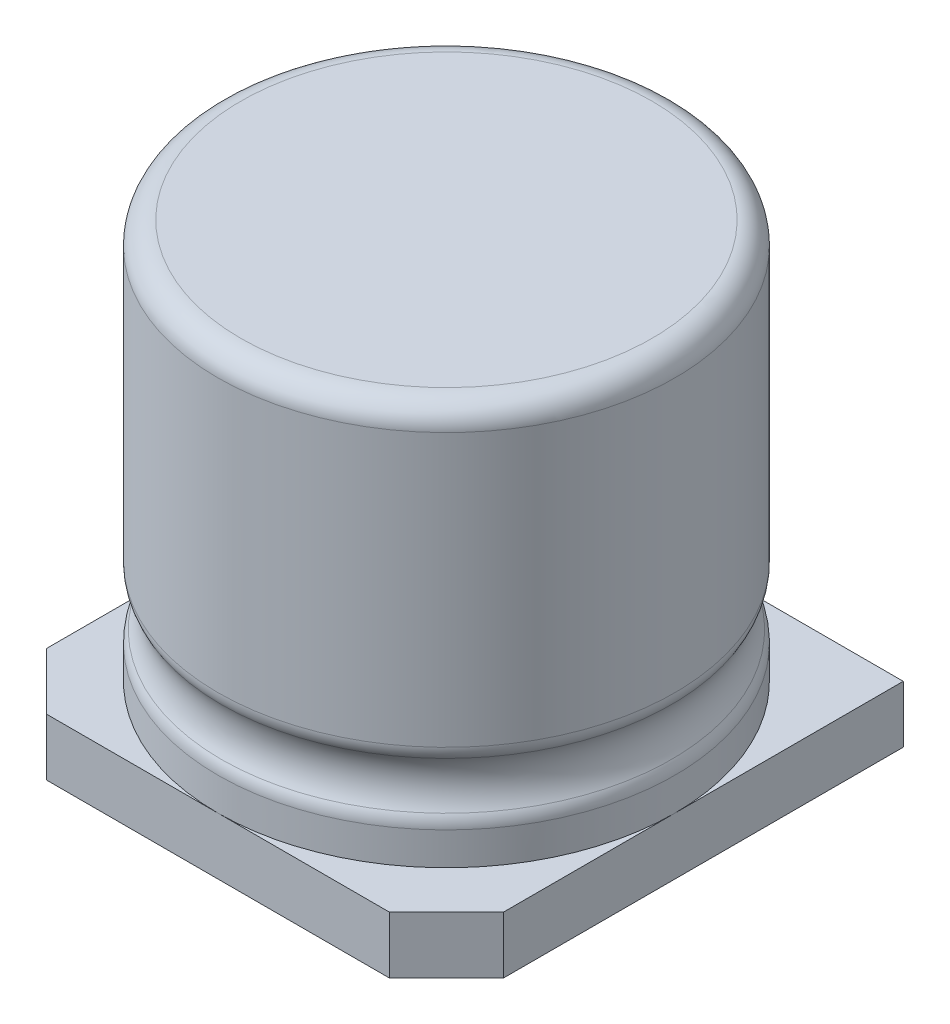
ISO-10303-21;
HEADER;
FILE_DESCRIPTION(('STEP AP214'),'2;1');
FILE_NAME('part.step','',(''),(''),'','','');
FILE_SCHEMA(('AUTOMOTIVE_DESIGN { 1 0 10303 214 1 1 1 1 }'));
ENDSEC;
DATA;
#1=APPLICATION_CONTEXT('core data for automotive mechanical design processes');
#2=APPLICATION_PROTOCOL_DEFINITION('international standard','automotive_design',2000,#1);
#3=PRODUCT_CONTEXT('',#1,'mechanical');
#4=PRODUCT('Part','Part','',(#3));
#5=PRODUCT_RELATED_PRODUCT_CATEGORY('part','',(#4));
#6=PRODUCT_DEFINITION_FORMATION('','',#4);
#7=PRODUCT_DEFINITION_CONTEXT('part definition',#1,'design');
#8=PRODUCT_DEFINITION('design','',#6,#7);
#9=PRODUCT_DEFINITION_SHAPE('','',#8);
#10=(LENGTH_UNIT() NAMED_UNIT(*) SI_UNIT(.MILLI.,.METRE.));
#11=(NAMED_UNIT(*) PLANE_ANGLE_UNIT() SI_UNIT($,.RADIAN.));
#12=(NAMED_UNIT(*) SI_UNIT($,.STERADIAN.) SOLID_ANGLE_UNIT());
#13=UNCERTAINTY_MEASURE_WITH_UNIT(LENGTH_MEASURE(1.E-05),#10,'distance_accuracy_value','');
#14=(GEOMETRIC_REPRESENTATION_CONTEXT(3) GLOBAL_UNCERTAINTY_ASSIGNED_CONTEXT((#13)) GLOBAL_UNIT_ASSIGNED_CONTEXT((#10,
#11,#12)) REPRESENTATION_CONTEXT('',''));
#15=CARTESIAN_POINT('',(0.,0.,0.));
#16=DIRECTION('',(0.,0.,1.));
#17=DIRECTION('',(1.,0.,0.));
#18=AXIS2_PLACEMENT_3D('',#15,#16,#17);
#19=CARTESIAN_POINT('',(28.63087999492,11.684,-29.66212));
#20=DIRECTION('',(0.,1.,0.));
#21=DIRECTION('',(0.,0.,-1.));
#22=AXIS2_PLACEMENT_3D('',#19,#20,#21);
#23=PLANE('',#22);
#24=CARTESIAN_POINT('',(23.8760000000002,11.684,-29.8449999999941));
#25=CARTESIAN_POINT('',(23.8487971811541,11.684,-29.8449998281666));
#26=CARTESIAN_POINT('',(23.8215943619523,11.6839999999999,-29.8452425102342));
#27=CARTESIAN_POINT('',(23.7671973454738,11.6839999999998,-29.8462133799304));
#28=CARTESIAN_POINT('',(23.7400031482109,11.6839999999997,-29.8469415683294));
#29=CARTESIAN_POINT('',(23.6856320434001,11.6839999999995,-29.8488832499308));
#30=CARTESIAN_POINT('',(23.6584551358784,11.6839999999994,-29.8500967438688));
#31=CARTESIAN_POINT('',(23.6041272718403,11.6839999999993,-29.8530086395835));
#32=CARTESIAN_POINT('',(23.5769763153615,11.6839999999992,-29.8547070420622));
#33=CARTESIAN_POINT('',(23.5227090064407,11.6839999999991,-29.8585882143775));
#34=CARTESIAN_POINT('',(23.4955926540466,11.6839999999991,-29.8607709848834));
#35=CARTESIAN_POINT('',(23.4414031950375,11.6839999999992,-29.8656201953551));
#36=CARTESIAN_POINT('',(23.4143300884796,11.6839999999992,-29.8682866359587));
#37=CARTESIAN_POINT('',(23.3602357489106,11.6839999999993,-29.874102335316));
#38=CARTESIAN_POINT('',(23.3332145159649,11.6839999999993,-29.8772515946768));
#39=CARTESIAN_POINT('',(23.2792325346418,11.6839999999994,-29.8840319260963));
#40=CARTESIAN_POINT('',(23.252271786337,11.6839999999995,-29.8876629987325));
#41=CARTESIAN_POINT('',(23.1984193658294,11.6839999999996,-29.8954057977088));
#42=CARTESIAN_POINT('',(23.1715276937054,11.6839999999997,-29.899517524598));
#43=CARTESIAN_POINT('',(23.117821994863,11.6839999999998,-29.9082203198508));
#44=CARTESIAN_POINT('',(23.091007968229,11.6839999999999,-29.9128113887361));
#45=CARTESIAN_POINT('',(23.0374661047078,11.6839999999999,-29.9224714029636));
#46=CARTESIAN_POINT('',(23.01073826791,11.684,-29.9275403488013));
#47=CARTESIAN_POINT('',(22.9573773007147,11.684,-29.9381544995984));
#48=CARTESIAN_POINT('',(22.9307441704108,11.684,-29.9436997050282));
#49=CARTESIAN_POINT('',(22.877581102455,11.684,-29.9552646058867));
#50=CARTESIAN_POINT('',(22.8510511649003,11.684,-29.961284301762));
#51=CARTESIAN_POINT('',(22.7981029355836,11.6839999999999,-29.9737962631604));
#52=CARTESIAN_POINT('',(22.7716846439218,11.6839999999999,-29.9802885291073));
#53=CARTESIAN_POINT('',(22.718968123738,11.6839999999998,-29.9937435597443));
#54=CARTESIAN_POINT('',(22.6926698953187,11.6839999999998,-30.0007063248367));
#55=CARTESIAN_POINT('',(22.6402018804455,11.6839999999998,-30.0151001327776));
#56=CARTESIAN_POINT('',(22.6140320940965,11.6839999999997,-30.022531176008));
#57=CARTESIAN_POINT('',(22.5618293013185,11.6839999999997,-30.0378591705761));
#58=CARTESIAN_POINT('',(22.5357962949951,11.6839999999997,-30.0457561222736));
#59=CARTESIAN_POINT('',(22.4838753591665,11.6839999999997,-30.0620134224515));
#60=CARTESIAN_POINT('',(22.4579874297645,11.6839999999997,-30.0703737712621));
#61=CARTESIAN_POINT('',(22.4063648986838,11.6839999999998,-30.087555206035));
#62=CARTESIAN_POINT('',(22.3806302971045,11.6839999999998,-30.0963762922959));
#63=CARTESIAN_POINT('',(22.329322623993,11.6839999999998,-30.1144763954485));
#64=CARTESIAN_POINT('',(22.3037495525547,11.6839999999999,-30.1237554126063));
#65=CARTESIAN_POINT('',(22.2527730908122,11.6839999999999,-30.142768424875));
#66=CARTESIAN_POINT('',(22.2273697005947,11.6839999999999,-30.1525024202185));
#67=CARTESIAN_POINT('',(22.17674069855,11.684,-30.1724222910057));
#68=CARTESIAN_POINT('',(22.1515150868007,11.684,-30.1826081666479));
#69=CARTESIAN_POINT('',(22.1012496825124,11.684,-30.2034285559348));
#70=CARTESIAN_POINT('',(22.0762098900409,11.684,-30.2140630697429));
#71=CARTESIAN_POINT('',(22.0263241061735,11.684,-30.2357773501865));
#72=CARTESIAN_POINT('',(22.0014781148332,11.684,-30.2468571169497));
#73=CARTESIAN_POINT('',(21.9519878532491,11.684,-30.2694583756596));
#74=CARTESIAN_POINT('',(21.9273435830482,11.684,-30.2809798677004));
#75=CARTESIAN_POINT('',(21.8782646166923,11.684,-30.304460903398));
#76=CARTESIAN_POINT('',(21.8538299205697,11.684,-30.3164204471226));
#77=CARTESIAN_POINT('',(21.8051778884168,11.684,-30.3407737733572));
#78=CARTESIAN_POINT('',(21.7809605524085,11.684,-30.3531675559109));
#79=CARTESIAN_POINT('',(21.7327509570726,11.684,-30.3783854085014));
#80=CARTESIAN_POINT('',(21.7087586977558,11.684,-30.3912094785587));
#81=CARTESIAN_POINT('',(21.6610069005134,11.684,-30.4172838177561));
#82=CARTESIAN_POINT('',(21.637247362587,11.684,-30.4305340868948));
#83=CARTESIAN_POINT('',(21.5899685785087,11.684,-30.4574566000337));
#84=CARTESIAN_POINT('',(21.5664493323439,11.684,-30.4711288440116));
#85=CARTESIAN_POINT('',(21.5196586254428,11.684,-30.4988909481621));
#86=CARTESIAN_POINT('',(21.4963871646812,11.684,-30.5129808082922));
#87=CARTESIAN_POINT('',(21.4500994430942,11.684,-30.5415736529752));
#88=CARTESIAN_POINT('',(21.4270831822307,11.684,-30.5560766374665));
#89=CARTESIAN_POINT('',(21.3813131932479,11.684,-30.5854911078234));
#90=CARTESIAN_POINT('',(21.3585594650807,11.684,-30.6004025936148));
#91=CARTESIAN_POINT('',(21.3133217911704,11.684,-30.630629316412));
#92=CARTESIAN_POINT('',(21.2908378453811,11.684,-30.6459445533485));
#93=CARTESIAN_POINT('',(21.2461468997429,11.684,-30.6769738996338));
#94=CARTESIAN_POINT('',(21.2239398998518,11.684,-30.6926880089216));
#95=CARTESIAN_POINT('',(21.179809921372,11.684,-30.7245100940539));
#96=CARTESIAN_POINT('',(21.1578869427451,11.684,-30.7406180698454));
#97=CARTESIAN_POINT('',(21.1143319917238,11.684,-30.7732227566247));
#98=CARTESIAN_POINT('',(21.0927000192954,11.684,-30.7897194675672));
#99=CARTESIAN_POINT('',(21.0497339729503,11.684,-30.8230963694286));
#100=CARTESIAN_POINT('',(21.0283998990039,11.684,-30.8399765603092));
#101=CARTESIAN_POINT('',(20.9860364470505,11.684,-30.8741150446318));
#102=CARTESIAN_POINT('',(20.9650070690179,11.684,-30.8913733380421));
#103=CARTESIAN_POINT('',(20.9232597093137,11.684,-30.9262625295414));
#104=CARTESIAN_POINT('',(20.9025417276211,11.684,-30.9438934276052));
#105=CARTESIAN_POINT('',(20.861423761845,11.684,-30.9795222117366));
#106=CARTESIAN_POINT('',(20.8410237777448,11.684,-30.9975200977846));
#107=CARTESIAN_POINT('',(20.8005483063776,11.684,-31.0338771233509));
#108=CARTESIAN_POINT('',(20.7804728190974,11.684,-31.0522362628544));
#109=CARTESIAN_POINT('',(20.740652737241,11.684,-31.0893099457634));
#110=CARTESIAN_POINT('',(20.7209081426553,11.684,-31.1080244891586));
#111=CARTESIAN_POINT('',(20.6817561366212,11.684,-31.1458030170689));
#112=CARTESIAN_POINT('',(20.6623487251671,11.684,-31.1648670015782));
#113=CARTESIAN_POINT('',(20.6238772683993,11.684,-31.2033383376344));
#114=CARTESIAN_POINT('',(20.6048132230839,11.684,-31.22274568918));
#115=CARTESIAN_POINT('',(20.5670345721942,11.684,-31.2618975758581));
#116=CARTESIAN_POINT('',(20.5483199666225,11.684,-31.2816421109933));
#117=CARTESIAN_POINT('',(20.511246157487,11.684,-31.3214620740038));
#118=CARTESIAN_POINT('',(20.4928869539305,11.684,-31.3415375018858));
#119=CARTESIAN_POINT('',(20.4565297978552,11.684,-31.3820128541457));
#120=CARTESIAN_POINT('',(20.4385318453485,11.684,-31.4024127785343));
#121=CARTESIAN_POINT('',(20.4029029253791,11.684,-31.4435306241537));
#122=CARTESIAN_POINT('',(20.3852719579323,11.684,-31.4642485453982));
#123=CARTESIAN_POINT('',(20.3503826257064,11.684,-31.5059957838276));
#124=CARTESIAN_POINT('',(20.333124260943,11.684,-31.5270251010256));
#125=CARTESIAN_POINT('',(20.2989856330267,11.684,-31.5693884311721));
#126=CARTESIAN_POINT('',(20.2821053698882,11.684,-31.5907224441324));
#127=CARTESIAN_POINT('',(20.2487283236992,11.684,-31.6336883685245));
#128=CARTESIAN_POINT('',(20.2322315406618,11.684,-31.6553202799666));
#129=CARTESIAN_POINT('',(20.1996267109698,11.684,-31.6988751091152));
#130=CARTESIAN_POINT('',(20.1835186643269,11.684,-31.7207980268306));
#131=CARTESIAN_POINT('',(20.1516964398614,11.684,-31.7649278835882));
#132=CARTESIAN_POINT('',(20.135982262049,11.684,-31.7871348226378));
#133=CARTESIAN_POINT('',(20.104952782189,11.684,-31.8318256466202));
#134=CARTESIAN_POINT('',(20.08963748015,11.684,-31.8543095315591));
#135=CARTESIAN_POINT('',(20.059410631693,11.684,-31.8995470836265));
#136=CARTESIAN_POINT('',(20.0444990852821,11.684,-31.9223007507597));
#137=CARTESIAN_POINT('',(20.0150844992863,11.684,-31.9680706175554));
#138=CARTESIAN_POINT('',(20.0005814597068,11.684,-31.9910868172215));
#139=CARTESIAN_POINT('',(19.9719885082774,11.684,-32.0373744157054));
#140=CARTESIAN_POINT('',(19.9578985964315,11.684,-32.0606458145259));
#141=CARTESIAN_POINT('',(19.9301363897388,11.684,-32.1074363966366));
#142=CARTESIAN_POINT('',(19.9164640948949,11.684,-32.1309555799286));
#143=CARTESIAN_POINT('',(19.8895414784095,11.684,-32.1782342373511));
#144=CARTESIAN_POINT('',(19.8762911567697,11.684,-32.2019937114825));
#145=CARTESIAN_POINT('',(19.8502167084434,11.684,-32.2497453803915));
#146=CARTESIAN_POINT('',(19.8373925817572,11.684,-32.2737375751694));
#147=CARTESIAN_POINT('',(19.8121746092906,11.684,-32.3219470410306));
#148=CARTESIAN_POINT('',(19.7997807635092,11.684,-32.3461643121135));
#149=CARTESIAN_POINT('',(19.7754273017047,11.684,-32.3948162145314));
#150=CARTESIAN_POINT('',(19.7634676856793,11.684,-32.4192508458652));
#151=CARTESIAN_POINT('',(19.7399864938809,11.684,-32.4683296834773));
#152=CARTESIAN_POINT('',(19.7284649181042,11.684,-32.4929738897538));
#153=CARTESIAN_POINT('',(19.7058634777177,11.684,-32.542464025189));
#154=CARTESIAN_POINT('',(19.6947836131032,11.684,-32.5673099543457));
#155=CARTESIAN_POINT('',(19.6730691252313,11.684,-32.6171956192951));
#156=CARTESIAN_POINT('',(19.6624345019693,11.684,-32.6422353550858));
#157=CARTESIAN_POINT('',(19.641613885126,11.684,-32.6925006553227));
#158=CARTESIAN_POINT('',(19.6314278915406,11.684,-32.7177262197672));
#159=CARTESIAN_POINT('',(19.611507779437,11.684,-32.7683551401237));
#160=CARTESIAN_POINT('',(19.6017736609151,11.684,-32.7937584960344));
#161=CARTESIAN_POINT('',(19.5827604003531,11.684,-32.8447349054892));
#162=CARTESIAN_POINT('',(19.5734812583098,11.684,-32.8703079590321));
#163=CARTESIAN_POINT('',(19.5553809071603,11.684,-32.9216156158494));
#164=CARTESIAN_POINT('',(19.5465596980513,11.684,-32.9473502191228));
#165=CARTESIAN_POINT('',(19.5293780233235,11.684,-32.9989727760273));
#166=CARTESIAN_POINT('',(19.5210175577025,11.684,-33.0248607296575));
#167=CARTESIAN_POINT('',(19.5047600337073,11.684,-33.0767817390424));
#168=CARTESIAN_POINT('',(19.4968629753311,11.684,-33.1028147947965));
#169=CARTESIAN_POINT('',(19.4815347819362,11.684,-33.1550177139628));
#170=CARTESIAN_POINT('',(19.474103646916,11.684,-33.1811875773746));
#171=CARTESIAN_POINT('',(19.4597096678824,11.684,-33.2336557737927));
#172=CARTESIAN_POINT('',(19.452746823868,11.684,-33.2599541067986));
#173=CARTESIAN_POINT('',(19.4392916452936,11.684,-33.3126708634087));
#174=CARTESIAN_POINT('',(19.432799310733,11.684,-33.3390892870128));
#175=CARTESIAN_POINT('',(19.4202872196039,11.684,-33.3920378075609));
#176=CARTESIAN_POINT('',(19.4142674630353,11.684,-33.418567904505));
#177=CARTESIAN_POINT('',(19.4027024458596,11.684,-33.4717313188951));
#178=CARTESIAN_POINT('',(19.3971571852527,11.684,-33.4983646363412));
#179=CARTESIAN_POINT('',(19.3865429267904,11.684,-33.5517260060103));
#180=CARTESIAN_POINT('',(19.3814739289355,11.684,-33.5784540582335));
#181=CARTESIAN_POINT('',(19.3718138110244,11.684,-33.6319963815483));
#182=CARTESIAN_POINT('',(19.3672226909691,11.684,-33.6588106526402));
#183=CARTESIAN_POINT('',(19.3585197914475,11.684,-33.7125168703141));
#184=CARTESIAN_POINT('',(19.3544080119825,11.684,-33.7394088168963));
#185=CARTESIAN_POINT('',(19.3466651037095,11.684,-33.7932618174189));
#186=CARTESIAN_POINT('',(19.343033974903,11.684,-33.8202228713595));
#187=CARTESIAN_POINT('',(19.3362535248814,11.684,-33.8742054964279));
#188=CARTESIAN_POINT('',(19.3331042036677,11.684,-33.9012270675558));
#189=CARTESIAN_POINT('',(19.3272883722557,11.684,-33.9553221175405));
#190=CARTESIAN_POINT('',(19.3246218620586,11.684,-33.9823955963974));
#191=CARTESIAN_POINT('',(19.3197725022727,11.684,-34.0365858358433));
#192=CARTESIAN_POINT('',(19.317589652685,11.684,-34.0637025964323));
#193=CARTESIAN_POINT('',(19.3137083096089,11.684,-34.1179707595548));
#194=CARTESIAN_POINT('',(19.3120098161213,11.684,-34.1451221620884));
#195=CARTESIAN_POINT('',(19.3090977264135,11.684,-34.1994509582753));
#196=CARTESIAN_POINT('',(19.3078841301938,11.684,-34.2266283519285));
#197=CARTESIAN_POINT('',(19.3059422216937,11.684,-34.2810004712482));
#198=CARTESIAN_POINT('',(19.3052139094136,11.684,-34.3081951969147));
#199=CARTESIAN_POINT('',(19.3042428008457,11.684,-34.3625933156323));
#200=CARTESIAN_POINT('',(19.3040000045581,11.684,-34.3897967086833));
#201=CARTESIAN_POINT('',(19.3040000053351,11.684,-34.4442034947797));
#202=CARTESIAN_POINT('',(19.3042428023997,11.684,-34.4714068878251));
#203=CARTESIAN_POINT('',(19.3052139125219,11.684,-34.52580500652));
#204=CARTESIAN_POINT('',(19.3059422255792,11.684,-34.5529997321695));
#205=CARTESIAN_POINT('',(19.3078841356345,11.684,-34.6073718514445));
#206=CARTESIAN_POINT('',(19.309097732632,11.684,-34.63454924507));
#207=CARTESIAN_POINT('',(19.3120098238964,11.684,-34.6888780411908));
#208=CARTESIAN_POINT('',(19.3137083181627,11.684,-34.7160294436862));
#209=CARTESIAN_POINT('',(19.3175896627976,11.684,-34.7702976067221));
#210=CARTESIAN_POINT('',(19.3197725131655,11.684,-34.7974143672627));
#211=CARTESIAN_POINT('',(19.324621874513,11.684,-34.8516046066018));
#212=CARTESIAN_POINT('',(19.3272883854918,11.684,-34.8786780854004));
#213=CARTESIAN_POINT('',(19.3331042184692,11.684,-34.9327731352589));
#214=CARTESIAN_POINT('',(19.3362535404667,11.684,-34.9597947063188));
#215=CARTESIAN_POINT('',(19.3430339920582,11.684,-35.0137773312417));
#216=CARTESIAN_POINT('',(19.346665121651,11.684,-35.0407383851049));
#217=CARTESIAN_POINT('',(19.3544080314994,11.684,-35.0945913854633));
#218=CARTESIAN_POINT('',(19.3585198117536,11.684,-35.1214833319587));
#219=CARTESIAN_POINT('',(19.3672227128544,11.684,-35.1751895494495));
#220=CARTESIAN_POINT('',(19.3718138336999,11.684,-35.2020038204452));
#221=CARTESIAN_POINT('',(19.3814739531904,11.684,-35.2555461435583));
#222=CARTESIAN_POINT('',(19.3865429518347,11.684,-35.282274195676));
#223=CARTESIAN_POINT('',(19.3971572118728,11.684,-35.335635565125));
#224=CARTESIAN_POINT('',(19.4027024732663,11.684,-35.3622688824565));
#225=CARTESIAN_POINT('',(19.4142674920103,11.684,-35.4154322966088));
#226=CARTESIAN_POINT('',(19.4202872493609,11.684,-35.4419623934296));
#227=CARTESIAN_POINT('',(19.4327993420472,11.684,-35.4949109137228));
#228=CARTESIAN_POINT('',(19.4392916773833,11.684,-35.5213293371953));
#229=CARTESIAN_POINT('',(19.4527468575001,11.684,-35.5740460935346));
#230=CARTESIAN_POINT('',(19.4597097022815,11.684,-35.6003444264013));
#231=CARTESIAN_POINT('',(19.4741036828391,11.684,-35.6528126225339));
#232=CARTESIAN_POINT('',(19.4815348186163,11.684,-35.6789824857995));
#233=CARTESIAN_POINT('',(19.4968630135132,11.684,-35.7311854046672));
#234=CARTESIAN_POINT('',(19.5047600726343,11.684,-35.7572184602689));
#235=CARTESIAN_POINT('',(19.5210175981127,11.684,-35.809139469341));
#236=CARTESIAN_POINT('',(19.5293780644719,11.684,-35.8350274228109));
#237=CARTESIAN_POINT('',(19.5465597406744,11.684,-35.8866499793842));
#238=CARTESIAN_POINT('',(19.5553809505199,11.684,-35.9123845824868));
#239=CARTESIAN_POINT('',(19.5734813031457,11.684,-35.9636922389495));
#240=CARTESIAN_POINT('',(19.5827604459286,11.684,-35.9892652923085));
#241=CARTESIAN_POINT('',(19.6017737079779,11.684,-36.0402417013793));
#242=CARTESIAN_POINT('',(19.6115078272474,11.684,-36.06564505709));
#243=CARTESIAN_POINT('',(19.6314279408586,11.684,-36.1162739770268));
#244=CARTESIAN_POINT('',(19.6416139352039,11.684,-36.1414995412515));
#245=CARTESIAN_POINT('',(19.6624345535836,11.684,-36.1917648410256));
#246=CARTESIAN_POINT('',(19.6730691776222,11.684,-36.2168045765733));
#247=CARTESIAN_POINT('',(19.6947836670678,11.684,-36.2666902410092));
#248=CARTESIAN_POINT('',(19.7058635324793,11.684,-36.2915361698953));
#249=CARTESIAN_POINT('',(19.7284649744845,11.684,-36.3410263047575));
#250=CARTESIAN_POINT('',(19.7399865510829,11.684,-36.3656705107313));
#251=CARTESIAN_POINT('',(19.7634677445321,11.684,-36.4147493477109));
#252=CARTESIAN_POINT('',(19.7754273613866,11.684,-36.4391839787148));
#253=CARTESIAN_POINT('',(19.7997808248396,11.684,-36.4878358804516));
#254=CARTESIAN_POINT('',(19.8121746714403,11.684,-36.5120531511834));
#255=CARTESIAN_POINT('',(19.8373926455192,11.684,-36.5602626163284));
#256=CARTESIAN_POINT('',(19.8502167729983,11.684,-36.5842548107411));
#257=CARTESIAN_POINT('',(19.8762912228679,11.684,-36.6320064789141));
#258=CARTESIAN_POINT('',(19.8895415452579,11.684,-36.6557659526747));
#259=CARTESIAN_POINT('',(19.9164641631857,11.684,-36.7030446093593));
#260=CARTESIAN_POINT('',(19.9301364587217,11.684,-36.7265637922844));
#261=CARTESIAN_POINT('',(19.9578986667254,11.684,-36.7733543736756));
#262=CARTESIAN_POINT('',(19.97198857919,11.684,-36.7966257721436));
#263=CARTESIAN_POINT('',(20.0005815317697,11.684,-36.8429133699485));
#264=CARTESIAN_POINT('',(20.0150845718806,11.684,-36.865929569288));
#265=CARTESIAN_POINT('',(20.0444991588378,11.684,-36.911699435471));
#266=CARTESIAN_POINT('',(20.0594107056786,11.684,-36.9344531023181));
#267=CARTESIAN_POINT('',(20.0896375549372,11.684,-36.9796906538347));
#268=CARTESIAN_POINT('',(20.104952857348,11.684,-37.002174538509));
#269=CARTESIAN_POINT('',(20.1359823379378,11.684,-37.0468653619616));
#270=CARTESIAN_POINT('',(20.1516965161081,11.684,-37.0690723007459));
#271=CARTESIAN_POINT('',(20.1835187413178,11.684,-37.1132021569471));
#272=CARTESIAN_POINT('',(20.199626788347,11.684,-37.1351250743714));
#273=CARTESIAN_POINT('',(20.2322316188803,11.684,-37.1786799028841));
#274=CARTESIAN_POINT('',(20.2487284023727,11.684,-37.2003118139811));
#275=CARTESIAN_POINT('',(20.2821054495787,11.684,-37.2432777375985));
#276=CARTESIAN_POINT('',(20.2989857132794,11.684,-37.264611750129));
#277=CARTESIAN_POINT('',(20.3331243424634,11.684,-37.3069750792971));
#278=CARTESIAN_POINT('',(20.3503827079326,11.684,-37.3280043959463));
#279=CARTESIAN_POINT('',(20.3852720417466,11.684,-37.3697516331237));
#280=CARTESIAN_POINT('',(20.4029030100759,11.684,-37.390469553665));
#281=CARTESIAN_POINT('',(20.4385319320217,11.684,-37.43158739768));
#282=CARTESIAN_POINT('',(20.4565298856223,11.684,-37.4519873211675));
#283=CARTESIAN_POINT('',(20.4928870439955,11.684,-37.492462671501));
#284=CARTESIAN_POINT('',(20.511246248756,11.684,-37.5125380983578));
#285=CARTESIAN_POINT('',(20.5483200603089,11.684,-37.5523580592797));
#286=CARTESIAN_POINT('',(20.5670346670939,11.684,-37.5721025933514));
#287=CARTESIAN_POINT('',(20.6048133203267,11.684,-37.6112544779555));
#288=CARTESIAN_POINT('',(20.6238773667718,11.684,-37.6306618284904));
#289=CARTESIAN_POINT('',(20.6623488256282,11.684,-37.6691331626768));
#290=CARTESIAN_POINT('',(20.6817562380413,11.684,-37.6881971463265));
#291=CARTESIAN_POINT('',(20.720908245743,11.684,-37.7259756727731));
#292=CARTESIAN_POINT('',(20.7406528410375,11.684,-37.7446902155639));
#293=CARTESIAN_POINT('',(20.7804729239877,11.684,-37.7817638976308));
#294=CARTESIAN_POINT('',(20.8005484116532,11.684,-37.8001230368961));
#295=CARTESIAN_POINT('',(20.841023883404,11.684,-37.8364800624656));
#296=CARTESIAN_POINT('',(20.8614238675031,11.684,-37.8544779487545));
#297=CARTESIAN_POINT('',(20.9025418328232,11.684,-37.8901067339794));
#298=CARTESIAN_POINT('',(20.9232598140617,11.684,-37.9077376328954));
#299=CARTESIAN_POINT('',(20.9650071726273,11.684,-37.9426268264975));
#300=CARTESIAN_POINT('',(20.9860365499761,11.684,-37.9598851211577));
#301=CARTESIAN_POINT('',(21.0284000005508,11.684,-37.9940236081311));
#302=CARTESIAN_POINT('',(21.0497340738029,11.684,-38.010903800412));
#303=CARTESIAN_POINT('',(21.0927001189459,11.684,-38.0442807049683));
#304=CARTESIAN_POINT('',(21.1143320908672,11.684,-38.0607774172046));
#305=CARTESIAN_POINT('',(21.1578870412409,11.684,-38.0933821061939));
#306=CARTESIAN_POINT('',(21.1798100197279,11.684,-38.1094900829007));
#307=CARTESIAN_POINT('',(21.2239399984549,11.684,-38.1413121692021));
#308=CARTESIAN_POINT('',(21.2461469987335,11.684,-38.1570262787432));
#309=CARTESIAN_POINT('',(21.2908379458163,11.684,-38.1880556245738));
#310=CARTESIAN_POINT('',(21.3133218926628,11.684,-38.2033708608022));
#311=CARTESIAN_POINT('',(21.3585595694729,11.684,-38.2335975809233));
#312=CARTESIAN_POINT('',(21.3813132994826,11.684,-38.2485090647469));
#313=CARTESIAN_POINT('',(21.4270832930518,11.684,-38.277923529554));
#314=CARTESIAN_POINT('',(21.4500995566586,11.684,-38.292426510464));
#315=CARTESIAN_POINT('',(21.4963872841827,11.684,-38.3210193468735));
#316=CARTESIAN_POINT('',(21.5196587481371,11.684,-38.3351092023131));
#317=CARTESIAN_POINT('',(21.5664494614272,11.684,-38.3628712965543));
#318=CARTESIAN_POINT('',(21.5899687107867,11.684,-38.3765435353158));
#319=CARTESIAN_POINT('',(21.6372475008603,11.684,-38.4034660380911));
#320=CARTESIAN_POINT('',(21.6610070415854,11.684,-38.4167163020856));
#321=CARTESIAN_POINT('',(21.7087588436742,11.684,-38.442790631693));
#322=CARTESIAN_POINT('',(21.7327511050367,11.684,-38.4556146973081));
#323=CARTESIAN_POINT('',(21.780960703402,11.684,-38.4808325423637));
#324=CARTESIAN_POINT('',(21.805178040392,11.684,-38.4932263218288));
#325=CARTESIAN_POINT('',(21.8538300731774,11.684,-38.5175796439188));
#326=CARTESIAN_POINT('',(21.878264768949,11.684,-38.5295391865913));
#327=CARTESIAN_POINT('',(21.9273437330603,11.684,-38.5530202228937));
#328=CARTESIAN_POINT('',(21.9519880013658,11.684,-38.564541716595));
#329=CARTESIAN_POINT('',(22.0014782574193,11.684,-38.587142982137));
#330=CARTESIAN_POINT('',(22.0263242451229,11.684,-38.5982227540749));
#331=CARTESIAN_POINT('',(22.0762100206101,11.684,-38.6199370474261));
#332=CARTESIAN_POINT('',(22.1012498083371,11.684,-38.6305715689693));
#333=CARTESIAN_POINT('',(22.1515152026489,11.684,-38.6513919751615));
#334=CARTESIAN_POINT('',(22.1767408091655,11.684,-38.6615778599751));
#335=CARTESIAN_POINT('',(22.227369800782,11.684,-38.6814977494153));
#336=CARTESIAN_POINT('',(22.2527731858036,11.684,-38.691231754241));
#337=CARTESIAN_POINT('',(22.3037496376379,11.684,-38.7102447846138));
#338=CARTESIAN_POINT('',(22.3293227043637,11.6839999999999,-38.719523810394));
#339=CARTESIAN_POINT('',(22.3806303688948,11.6839999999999,-38.7376239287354));
#340=CARTESIAN_POINT('',(22.4063649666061,11.6839999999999,-38.7464450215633));
#341=CARTESIAN_POINT('',(22.4579874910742,11.6839999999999,-38.7636264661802));
#342=CARTESIAN_POINT('',(22.4838754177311,11.6839999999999,-38.7719868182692));
#343=CARTESIAN_POINT('',(22.5357963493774,11.6839999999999,-38.7882441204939));
#344=CARTESIAN_POINT('',(22.5618293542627,11.6839999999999,-38.7961410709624));
#345=CARTESIAN_POINT('',(22.6140321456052,11.6839999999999,-38.8114690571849));
#346=CARTESIAN_POINT('',(22.6402019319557,11.6839999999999,-38.8189000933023));
#347=CARTESIAN_POINT('',(22.6926699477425,11.6839999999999,-38.8332938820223));
#348=CARTESIAN_POINT('',(22.7189681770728,11.6839999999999,-38.8402566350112));
#349=CARTESIAN_POINT('',(22.7716846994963,11.684,-38.8537116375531));
#350=CARTESIAN_POINT('',(22.7981029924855,11.684,-38.8602038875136));
#351=CARTESIAN_POINT('',(22.8510512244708,11.684,-38.8727158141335));
#352=CARTESIAN_POINT('',(22.8775811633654,11.684,-38.8787354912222));
#353=CARTESIAN_POINT('',(22.9307442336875,11.684,-38.8903003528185));
#354=CARTESIAN_POINT('',(22.9573773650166,11.684,-38.8958455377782));
#355=CARTESIAN_POINT('',(23.010738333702,11.684,-38.906459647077));
#356=CARTESIAN_POINT('',(23.0374661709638,11.684,-38.9115285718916));
#357=CARTESIAN_POINT('',(23.091008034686,11.6839999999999,-38.9211885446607));
#358=CARTESIAN_POINT('',(23.1178220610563,11.6839999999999,-38.9257795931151));
#359=CARTESIAN_POINT('',(23.1715277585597,11.6839999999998,-38.9344823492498));
#360=CARTESIAN_POINT('',(23.1984194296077,11.6839999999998,-38.9385940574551));
#361=CARTESIAN_POINT('',(23.2522718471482,11.6839999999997,-38.9463368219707));
#362=CARTESIAN_POINT('',(23.2792325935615,11.6839999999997,-38.9499678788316));
#363=CARTESIAN_POINT('',(23.3332145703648,11.6839999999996,-38.9567481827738));
#364=CARTESIAN_POINT('',(23.3602358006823,11.6839999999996,-38.9598974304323));
#365=CARTESIAN_POINT('',(23.4143301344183,11.6839999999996,-38.965713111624));
#366=CARTESIAN_POINT('',(23.4414032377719,11.6839999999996,-38.9683795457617));
#367=CARTESIAN_POINT('',(23.4955926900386,11.6839999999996,-38.9732287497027));
#368=CARTESIAN_POINT('',(23.5227090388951,11.6839999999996,-38.9754115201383));
#369=CARTESIAN_POINT('',(23.5769763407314,11.6839999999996,-38.9792926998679));
#370=CARTESIAN_POINT('',(23.6041272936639,11.6839999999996,-38.9809911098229));
#371=CARTESIAN_POINT('',(23.6584551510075,11.6839999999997,-38.9839030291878));
#372=CARTESIAN_POINT('',(23.6856320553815,11.6839999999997,-38.9851165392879));
#373=CARTESIAN_POINT('',(23.7400031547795,11.6839999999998,-38.9870582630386));
#374=CARTESIAN_POINT('',(23.7671973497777,11.6839999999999,-38.9877864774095));
#375=CARTESIAN_POINT('',(23.821594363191,11.684,-38.9887574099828));
#376=CARTESIAN_POINT('',(23.8487971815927,11.684,-38.9890001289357));
#377=CARTESIAN_POINT('',(23.875999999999,11.684,-38.9890000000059));
#378=B_SPLINE_CURVE_WITH_KNOTS('',3,(#24,#25,#26,#27,#28,#29,#30,#31,#32,#33,#34,#35,#36,#37,
#38,#39,#40,#41,#42,#43,#44,#45,#46,#47,#48,#49,#50,#51,#52,#53,#54,#55,#56,#57,#58,#59,#60,#61,
#62,#63,#64,#65,#66,#67,#68,#69,#70,#71,#72,#73,#74,#75,#76,#77,#78,#79,#80,#81,#82,#83,#84,#85,
#86,#87,#88,#89,#90,#91,#92,#93,#94,#95,#96,#97,#98,#99,#100,#101,#102,#103,#104,#105,#106,#107,
#108,#109,#110,#111,#112,#113,#114,#115,#116,#117,#118,#119,#120,#121,#122,#123,#124,#125,#126,
#127,#128,#129,#130,#131,#132,#133,#134,#135,#136,#137,#138,#139,#140,#141,#142,#143,#144,#145,
#146,#147,#148,#149,#150,#151,#152,#153,#154,#155,#156,#157,#158,#159,#160,#161,#162,#163,#164,
#165,#166,#167,#168,#169,#170,#171,#172,#173,#174,#175,#176,#177,#178,#179,#180,#181,#182,#183,
#184,#185,#186,#187,#188,#189,#190,#191,#192,#193,#194,#195,#196,#197,#198,#199,#200,#201,#202,
#203,#204,#205,#206,#207,#208,#209,#210,#211,#212,#213,#214,#215,#216,#217,#218,#219,#220,#221,
#222,#223,#224,#225,#226,#227,#228,#229,#230,#231,#232,#233,#234,#235,#236,#237,#238,#239,#240,
#241,#242,#243,#244,#245,#246,#247,#248,#249,#250,#251,#252,#253,#254,#255,#256,#257,#258,#259,
#260,#261,#262,#263,#264,#265,#266,#267,#268,#269,#270,#271,#272,#273,#274,#275,#276,#277,#278,
#279,#280,#281,#282,#283,#284,#285,#286,#287,#288,#289,#290,#291,#292,#293,#294,#295,#296,#297,
#298,#299,#300,#301,#302,#303,#304,#305,#306,#307,#308,#309,#310,#311,#312,#313,#314,#315,#316,
#317,#318,#319,#320,#321,#322,#323,#324,#325,#326,#327,#328,#329,#330,#331,#332,#333,#334,#335,
#336,#337,#338,#339,#340,#341,#342,#343,#344,#345,#346,#347,#348,#349,#350,#351,#352,#353,#354,
#355,#356,#357,#358,#359,#360,#361,#362,#363,#364,#365,#366,#367,#368,#369,#370,#371,#372,#373,
#374,#375,#376,#377),.UNSPECIFIED.,.F.,.F.,(4,2,2,2,2,2,2,2,2,2,2,2,2,2,2,2,2,2,2,2,2,2,2,2,2,2,
2,2,2,2,2,2,2,2,2,2,2,2,2,2,2,2,2,2,2,2,2,2,2,2,2,2,2,2,2,2,2,2,2,2,2,2,2,2,2,2,2,2,2,2,2,2,2,2,
2,2,2,2,2,2,2,2,2,2,2,2,2,2,2,2,2,2,2,2,2,2,2,2,2,2,2,2,2,2,2,2,2,2,2,2,2,2,2,2,2,2,2,2,2,2,2,2,
2,2,2,2,2,2,2,2,2,2,2,2,2,2,2,2,2,2,2,2,2,2,2,2,2,2,2,2,2,2,2,2,2,2,2,2,2,2,2,2,2,2,2,2,2,2,2,2,
2,2,2,2,2,2,4),(0.,0.0816073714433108,0.163214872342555,0.244822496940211,0.326430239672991,
0.408038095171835,0.489646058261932,0.571254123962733,0.652862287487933,0.734470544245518,
0.816078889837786,0.897687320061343,0.97929583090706,1.0609044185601,1.1425130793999,
1.2241218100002,1.30573060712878,1.38733946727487,1.46894838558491,1.55055735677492,
1.63216637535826,1.71377543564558,1.79538453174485,1.87699365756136,1.95860280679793,
2.04021197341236,2.12182115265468,2.20343034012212,2.2850395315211,2.36664872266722,
2.44825790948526,2.52986708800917,2.61147625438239,2.69308540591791,2.7746945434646,
2.85630366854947,2.93791278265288,3.01952188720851,3.10113098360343,3.18274007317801,
3.26434915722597,3.3459582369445,3.42756731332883,3.50917638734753,3.59078545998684,
3.67239453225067,3.7540036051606,3.83561267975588,3.9172217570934,3.99883083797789,
4.08043992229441,4.16204900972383,4.24365809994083,4.3252671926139,4.40687628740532,
4.4884853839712,4.57009448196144,4.65170358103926,4.73331268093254,4.8149217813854,
4.896530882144,4.97813998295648,5.05974908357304,5.14135818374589,5.22296728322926,
5.30457638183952,5.38618547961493,5.46779457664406,5.54940367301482,5.6310127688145,
5.71262186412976,5.79423095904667,5.87584005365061,5.95744914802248,6.0390582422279,
6.12066733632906,6.20227643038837,6.28388552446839,6.36549461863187,6.44710371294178,
6.52871280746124,6.61032190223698,6.6919309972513,6.7735400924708,6.855149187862,
6.93675828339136,7.01836737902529,7.0999764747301,7.18158557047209,7.26319466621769,
7.34480376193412,7.42641285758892,7.50802195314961,7.58963104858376,7.67124014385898,
7.75284923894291,7.83445833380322,7.91606742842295,7.99767652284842,8.07928561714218,
8.16089471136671,8.24250380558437,8.32411289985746,8.40572199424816,8.48733108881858,
8.56894018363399,8.65054927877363,8.73215837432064,8.81376747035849,8.89537656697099,
8.97698566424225,9.05859476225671,9.14020386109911,9.22181296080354,9.30342206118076,
9.3850311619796,9.46664026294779,9.54824936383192,9.62985846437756,9.71146756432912,
9.79307666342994,9.87468576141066,9.95629485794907,10.0379039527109,10.1195130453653,
10.2011221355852,10.2827312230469,10.3643403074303,10.4459493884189,10.5275584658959,
10.6091675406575,10.6907766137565,10.7723856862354,10.8539947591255,10.9356038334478,
11.0172129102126,11.0988219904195,11.1804310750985,11.262040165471,11.3436492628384,
11.4252583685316,11.5068674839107,11.5884766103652,11.6700857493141,11.7516949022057,
11.8333040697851,11.9149132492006,11.9965224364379,12.0781316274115,12.1597408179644,
12.241350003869,12.322959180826,12.4045683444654,12.4861774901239,12.5677866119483,
12.6493957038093,12.7310047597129,12.8126137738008,12.8942227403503,12.9758316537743,
13.0574405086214,13.1390492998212,13.2206580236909,13.3022666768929,13.3838752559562,
13.465483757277,13.547092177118,13.6287005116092,13.7103087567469,13.7919169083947,
13.8735249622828,13.9551329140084,14.0367407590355,14.1183484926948,14.1999561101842,
14.2815636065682,14.3631709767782),.UNSPECIFIED.);
#379=CARTESIAN_POINT('',(23.8760000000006,11.684,-38.9890000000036));
#380=VERTEX_POINT('',#379);
#381=CARTESIAN_POINT('',(23.8760000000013,11.684,-29.8449999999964));
#382=VERTEX_POINT('',#381);
#383=EDGE_CURVE('E198',#380,#382,#378,.F.);
#384=ORIENTED_EDGE('',*,*,#383,.T.);
#385=CARTESIAN_POINT('',(23.876,11.684,-34.417));
#386=DIRECTION('',(0.,-1.,0.));
#387=DIRECTION('',(0.,0.,-1.));
#388=AXIS2_PLACEMENT_3D('',#385,#386,#387);
#389=CIRCLE('',#388,4.57200000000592);
#390=EDGE_CURVE('E248',#382,#380,#389,.F.);
#391=ORIENTED_EDGE('',*,*,#390,.T.);
#392=EDGE_LOOP('',(#384,#391));
#393=FACE_BOUND('',#392,.T.);
#394=ADVANCED_FACE('F15',(#393),#23,.T.);
#395=CARTESIAN_POINT('',(23.876,11.176,-34.417));
#396=DIRECTION('',(0.,1.,0.));
#397=DIRECTION('',(0.00532644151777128,0.,-0.999985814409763));
#398=AXIS2_PLACEMENT_3D('',#395,#396,#397);
#399=TOROIDAL_SURFACE('',#398,4.57200000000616,0.508);
#400=CARTESIAN_POINT('',(23.876,11.1759999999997,-34.417));
#401=DIRECTION('',(0.,1.,0.));
#402=DIRECTION('',(0.,0.,-1.));
#403=AXIS2_PLACEMENT_3D('',#400,#401,#402);
#404=CIRCLE('',#403,5.08);
#405=CARTESIAN_POINT('',(23.876,11.1759999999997,-39.497));
#406=VERTEX_POINT('',#405);
#407=EDGE_CURVE('E251',#406,#406,#404,.T.);
#408=ORIENTED_EDGE('',*,*,#407,.T.);
#409=EDGE_LOOP('',(#408));
#410=FACE_BOUND('',#409,.T.);
#411=ORIENTED_EDGE('',*,*,#390,.F.);
#412=ORIENTED_EDGE('',*,*,#383,.F.);
#413=EDGE_LOOP('',(#411,#412));
#414=FACE_BOUND('',#413,.T.);
#415=ADVANCED_FACE('F205',(#410,#414),#399,.T.);
#416=CARTESIAN_POINT('',(23.876,5.11359751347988,-34.417));
#417=DIRECTION('',(0.,1.,0.));
#418=DIRECTION('',(0.,0.,1.));
#419=AXIS2_PLACEMENT_3D('',#416,#417,#418);
#420=CYLINDRICAL_SURFACE('',#419,5.08);
#421=CARTESIAN_POINT('',(23.876,5.11359751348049,-34.417));
#422=DIRECTION('',(0.,1.,0.));
#423=DIRECTION('',(0.00558332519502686,0.,-0.999984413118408));
#424=AXIS2_PLACEMENT_3D('',#421,#422,#423);
#425=CIRCLE('',#424,5.07999999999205);
#426=CARTESIAN_POINT('',(23.9043632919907,5.11359751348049,-39.4969208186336));
#427=VERTEX_POINT('',#426);
#428=EDGE_CURVE('E194',#427,#427,#425,.T.);
#429=ORIENTED_EDGE('',*,*,#428,.T.);
#430=EDGE_LOOP('',(#429));
#431=FACE_BOUND('',#430,.T.);
#432=ORIENTED_EDGE('',*,*,#407,.F.);
#433=EDGE_LOOP('',(#432));
#434=FACE_BOUND('',#433,.T.);
#435=ADVANCED_FACE('F214',(#431,#434),#420,.T.);
#436=CARTESIAN_POINT('',(23.876,5.11359751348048,-34.417));
#437=DIRECTION('',(0.,1.,0.));
#438=DIRECTION('',(0.00558332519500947,0.,-0.999984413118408));
#439=AXIS2_PLACEMENT_3D('',#436,#437,#438);
#440=TOROIDAL_SURFACE('',#439,4.57199999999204,0.508);
#441=CARTESIAN_POINT('',(23.876,4.84640579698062,-34.417));
#442=DIRECTION('',(0.,-1.,0.));
#443=DIRECTION('',(0.,0.,1.));
#444=AXIS2_PLACEMENT_3D('',#441,#442,#443);
#445=CIRCLE('',#444,5.00405623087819);
#446=CARTESIAN_POINT('',(23.876,4.84640579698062,-29.4129437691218));
#447=VERTEX_POINT('',#446);
#448=EDGE_CURVE('E101',#447,#447,#445,.T.);
#449=ORIENTED_EDGE('',*,*,#448,.F.);
#450=EDGE_LOOP('',(#449));
#451=FACE_BOUND('',#450,.T.);
#452=ORIENTED_EDGE('',*,*,#428,.F.);
#453=EDGE_LOOP('',(#452));
#454=FACE_BOUND('',#453,.T.);
#455=ADVANCED_FACE('F162',(#451,#454),#440,.T.);
#456=CARTESIAN_POINT('',(18.5928,2.794,-29.1338));
#457=DIRECTION('',(0.,-1.,0.));
#458=DIRECTION('',(0.,0.,-1.));
#459=AXIS2_PLACEMENT_3D('',#456,#457,#458);
#460=PLANE('',#459);
#461=DIRECTION('',(-0.707106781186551,0.,0.707106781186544));
#462=VECTOR('',#461,1.);
#463=CARTESIAN_POINT('',(28.321,2.794,-29.972));
#464=LINE('',#463,#462);
#465=CARTESIAN_POINT('',(28.956,2.794,-30.607));
#466=VERTEX_POINT('',#465);
#467=CARTESIAN_POINT('',(27.686,2.794,-29.337));
#468=VERTEX_POINT('',#467);
#469=EDGE_CURVE('E117',#466,#468,#464,.T.);
#470=ORIENTED_EDGE('',*,*,#469,.F.);
#471=DIRECTION('',(0.,0.,1.));
#472=VECTOR('',#471,1.);
#473=CARTESIAN_POINT('',(28.956,2.794,-35.052));
#474=LINE('',#473,#472);
#475=CARTESIAN_POINT('',(28.956,2.794,-34.4170000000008));
#476=VERTEX_POINT('',#475);
#477=EDGE_CURVE('E115',#476,#466,#474,.T.);
#478=ORIENTED_EDGE('',*,*,#477,.F.);
#479=CARTESIAN_POINT('',(23.876,2.79400000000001,-34.417));
#480=DIRECTION('',(0.,1.,0.));
#481=DIRECTION('',(0.,0.,1.));
#482=AXIS2_PLACEMENT_3D('',#479,#480,#481);
#483=CIRCLE('',#482,5.08);
#484=CARTESIAN_POINT('',(23.8760000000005,2.794,-29.337));
#485=VERTEX_POINT('',#484);
#486=EDGE_CURVE('E86',#476,#485,#483,.F.);
#487=ORIENTED_EDGE('',*,*,#486,.T.);
#488=DIRECTION('',(-1.,0.,0.));
#489=VECTOR('',#488,1.);
#490=CARTESIAN_POINT('',(23.876,2.794,-29.337));
#491=LINE('',#490,#489);
#492=EDGE_CURVE('E316',#468,#485,#491,.T.);
#493=ORIENTED_EDGE('',*,*,#492,.F.);
#494=EDGE_LOOP('',(#470,#478,#487,#493));
#495=FACE_BOUND('',#494,.T.);
#496=ADVANCED_FACE('F116',(#495),#460,.F.);
#497=CARTESIAN_POINT('',(23.876,4.318,-34.417));
#498=DIRECTION('',(0.,-1.,0.));
#499=DIRECTION('',(0.,0.,1.));
#500=AXIS2_PLACEMENT_3D('',#497,#498,#499);
#501=TOROIDAL_SURFACE('',#500,5.8585026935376,1.00463498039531);
#502=CARTESIAN_POINT('',(23.876,3.78959420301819,-34.417));
#503=DIRECTION('',(0.,1.,0.));
#504=DIRECTION('',(0.0051215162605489,0.,0.999986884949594));
#505=AXIS2_PLACEMENT_3D('',#502,#503,#504);
#506=CIRCLE('',#505,5.0040562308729);
#507=CARTESIAN_POINT('',(23.9016283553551,3.78959420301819,-29.4130093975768));
#508=VERTEX_POINT('',#507);
#509=EDGE_CURVE('E144',#508,#508,#506,.T.);
#510=ORIENTED_EDGE('',*,*,#509,.T.);
#511=EDGE_LOOP('',(#510));
#512=FACE_BOUND('',#511,.T.);
#513=ORIENTED_EDGE('',*,*,#448,.T.);
#514=EDGE_LOOP('',(#513));
#515=FACE_BOUND('',#514,.T.);
#516=ADVANCED_FACE('F156',(#512,#515),#501,.F.);
#517=CARTESIAN_POINT('',(18.7706,1.4986,-30.6324));
#518=DIRECTION('',(-0.707106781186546,0.,0.707106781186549));
#519=DIRECTION('',(0.707106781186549,0.,0.707106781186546));
#520=AXIS2_PLACEMENT_3D('',#517,#518,#519);
#521=PLANE('',#520);
#522=DIRECTION('',(-0.707106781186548,0.,-0.707106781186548));
#523=VECTOR('',#522,1.);
#524=CARTESIAN_POINT('',(20.066,1.524,-29.337));
#525=LINE('',#524,#523);
#526=CARTESIAN_POINT('',(20.066,1.524,-29.337));
#527=VERTEX_POINT('',#526);
#528=CARTESIAN_POINT('',(18.796,1.524,-30.607));
#529=VERTEX_POINT('',#528);
#530=EDGE_CURVE('E127',#527,#529,#525,.T.);
#531=ORIENTED_EDGE('',*,*,#530,.F.);
#532=DIRECTION('',(0.,-1.,0.));
#533=VECTOR('',#532,1.);
#534=CARTESIAN_POINT('',(20.066,2.159,-29.337));
#535=LINE('',#534,#533);
#536=CARTESIAN_POINT('',(20.066,2.794,-29.337));
#537=VERTEX_POINT('',#536);
#538=EDGE_CURVE('E174',#537,#527,#535,.T.);
#539=ORIENTED_EDGE('',*,*,#538,.F.);
#540=DIRECTION('',(0.707106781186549,0.,0.707106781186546));
#541=VECTOR('',#540,1.);
#542=CARTESIAN_POINT('',(18.7706,2.794,-30.6324));
#543=LINE('',#542,#541);
#544=CARTESIAN_POINT('',(18.796,2.794,-30.607));
#545=VERTEX_POINT('',#544);
#546=EDGE_CURVE('E112',#537,#545,#543,.F.);
#547=ORIENTED_EDGE('',*,*,#546,.T.);
#548=DIRECTION('',(0.,-1.,0.));
#549=VECTOR('',#548,1.);
#550=CARTESIAN_POINT('',(18.7959999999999,2.159,-30.6070000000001));
#551=LINE('',#550,#549);
#552=EDGE_CURVE('E100',#545,#529,#551,.T.);
#553=ORIENTED_EDGE('',*,*,#552,.T.);
#554=EDGE_LOOP('',(#531,#539,#547,#553));
#555=FACE_BOUND('',#554,.T.);
#556=ADVANCED_FACE('F160',(#555),#521,.T.);
#557=CARTESIAN_POINT('',(28.956,2.8194,-39.6748));
#558=DIRECTION('',(1.,0.,0.));
#559=DIRECTION('',(0.,0.,1.));
#560=AXIS2_PLACEMENT_3D('',#557,#558,#559);
#561=PLANE('',#560);
#562=DIRECTION('',(0.,0.,1.));
#563=VECTOR('',#562,1.);
#564=CARTESIAN_POINT('',(28.956,1.524,-34.417));
#565=LINE('',#564,#563);
#566=CARTESIAN_POINT('',(28.956,1.524,-39.497));
#567=VERTEX_POINT('',#566);
#568=CARTESIAN_POINT('',(28.956,1.524,-30.607));
#569=VERTEX_POINT('',#568);
#570=EDGE_CURVE('E132',#567,#569,#565,.T.);
#571=ORIENTED_EDGE('',*,*,#570,.F.);
#572=DIRECTION('',(0.,1.,0.));
#573=VECTOR('',#572,1.);
#574=CARTESIAN_POINT('',(28.956,2.159,-39.497));
#575=LINE('',#574,#573);
#576=CARTESIAN_POINT('',(28.956,2.794,-39.497));
#577=VERTEX_POINT('',#576);
#578=EDGE_CURVE('E122',#567,#577,#575,.T.);
#579=ORIENTED_EDGE('',*,*,#578,.T.);
#580=DIRECTION('',(0.,0.,1.));
#581=VECTOR('',#580,1.);
#582=CARTESIAN_POINT('',(28.956,2.794,-34.417));
#583=LINE('',#582,#581);
#584=EDGE_CURVE('E108',#577,#476,#583,.T.);
#585=ORIENTED_EDGE('',*,*,#584,.T.);
#586=ORIENTED_EDGE('',*,*,#477,.T.);
#587=DIRECTION('',(0.,1.,0.));
#588=VECTOR('',#587,1.);
#589=CARTESIAN_POINT('',(28.9560000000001,2.159,-30.6070000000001));
#590=LINE('',#589,#588);
#591=EDGE_CURVE('E179',#569,#466,#590,.T.);
#592=ORIENTED_EDGE('',*,*,#591,.F.);
#593=EDGE_LOOP('',(#571,#579,#585,#586,#592));
#594=FACE_BOUND('',#593,.T.);
#595=ADVANCED_FACE('F125',(#594),#561,.T.);
#596=CARTESIAN_POINT('',(27.6606,1.4986,-29.3116));
#597=DIRECTION('',(0.707106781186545,0.,0.70710678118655));
#598=DIRECTION('',(0.70710678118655,0.,-0.707106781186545));
#599=AXIS2_PLACEMENT_3D('',#596,#597,#598);
#600=PLANE('',#599);
#601=DIRECTION('',(-0.707106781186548,0.,0.707106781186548));
#602=VECTOR('',#601,1.);
#603=CARTESIAN_POINT('',(28.956,1.524,-30.607));
#604=LINE('',#603,#602);
#605=CARTESIAN_POINT('',(27.686,1.524,-29.337));
#606=VERTEX_POINT('',#605);
#607=EDGE_CURVE('E243',#569,#606,#604,.T.);
#608=ORIENTED_EDGE('',*,*,#607,.F.);
#609=ORIENTED_EDGE('',*,*,#591,.T.);
#610=ORIENTED_EDGE('',*,*,#469,.T.);
#611=DIRECTION('',(0.,1.,0.));
#612=VECTOR('',#611,1.);
#613=CARTESIAN_POINT('',(27.686,2.159,-29.337));
#614=LINE('',#613,#612);
#615=EDGE_CURVE('E170',#606,#468,#614,.T.);
#616=ORIENTED_EDGE('',*,*,#615,.F.);
#617=EDGE_LOOP('',(#608,#609,#610,#616));
#618=FACE_BOUND('',#617,.T.);
#619=ADVANCED_FACE('F318',(#618),#600,.T.);
#620=CARTESIAN_POINT('',(27.8384,2.8194,-29.337));
#621=DIRECTION('',(0.,0.,1.));
#622=DIRECTION('',(-1.,0.,0.));
#623=AXIS2_PLACEMENT_3D('',#620,#621,#622);
#624=PLANE('',#623);
#625=DIRECTION('',(-1.,0.,0.));
#626=VECTOR('',#625,1.);
#627=CARTESIAN_POINT('',(23.876,1.524,-29.337));
#628=LINE('',#627,#626);
#629=EDGE_CURVE('E185',#606,#527,#628,.T.);
#630=ORIENTED_EDGE('',*,*,#629,.F.);
#631=ORIENTED_EDGE('',*,*,#615,.T.);
#632=ORIENTED_EDGE('',*,*,#492,.T.);
#633=DIRECTION('',(-1.,0.,0.));
#634=VECTOR('',#633,1.);
#635=CARTESIAN_POINT('',(23.876,2.794,-29.337));
#636=LINE('',#635,#634);
#637=EDGE_CURVE('E140',#485,#537,#636,.T.);
#638=ORIENTED_EDGE('',*,*,#637,.T.);
#639=ORIENTED_EDGE('',*,*,#538,.T.);
#640=EDGE_LOOP('',(#630,#631,#632,#638,#639));
#641=FACE_BOUND('',#640,.T.);
#642=ADVANCED_FACE('F154',(#641),#624,.T.);
#643=CARTESIAN_POINT('',(23.876,3.52240248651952,-34.417));
#644=DIRECTION('',(0.,1.,0.));
#645=DIRECTION('',(0.00512151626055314,0.,0.999986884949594));
#646=AXIS2_PLACEMENT_3D('',#643,#644,#645);
#647=TOROIDAL_SURFACE('',#646,4.57200000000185,0.508);
#648=ORIENTED_EDGE('',*,*,#509,.F.);
#649=EDGE_LOOP('',(#648));
#650=FACE_BOUND('',#649,.T.);
#651=CARTESIAN_POINT('',(23.876,3.52240248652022,-34.417));
#652=DIRECTION('',(0.,1.,0.));
#653=DIRECTION('',(0.,0.,-1.));
#654=AXIS2_PLACEMENT_3D('',#651,#652,#653);
#655=CIRCLE('',#654,5.08);
#656=CARTESIAN_POINT('',(23.876,3.52240248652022,-39.497));
#657=VERTEX_POINT('',#656);
#658=EDGE_CURVE('E182',#657,#657,#655,.T.);
#659=ORIENTED_EDGE('',*,*,#658,.T.);
#660=EDGE_LOOP('',(#659));
#661=FACE_BOUND('',#660,.T.);
#662=ADVANCED_FACE('F149',(#650,#661),#647,.T.);
#663=CARTESIAN_POINT('',(18.5928,2.794,-29.1338));
#664=DIRECTION('',(0.,-1.,0.));
#665=DIRECTION('',(0.,0.,-1.));
#666=AXIS2_PLACEMENT_3D('',#663,#664,#665);
#667=PLANE('',#666);
#668=ORIENTED_EDGE('',*,*,#546,.F.);
#669=ORIENTED_EDGE('',*,*,#637,.F.);
#670=CARTESIAN_POINT('',(23.876,2.79400000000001,-34.417));
#671=DIRECTION('',(0.,1.,0.));
#672=DIRECTION('',(0.,0.,1.));
#673=AXIS2_PLACEMENT_3D('',#670,#671,#672);
#674=CIRCLE('',#673,5.08);
#675=CARTESIAN_POINT('',(18.796,2.794,-34.4169999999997));
#676=VERTEX_POINT('',#675);
#677=EDGE_CURVE('E94',#485,#676,#674,.F.);
#678=ORIENTED_EDGE('',*,*,#677,.T.);
#679=DIRECTION('',(0.,0.,-1.));
#680=VECTOR('',#679,1.);
#681=CARTESIAN_POINT('',(18.796,2.794,-35.052));
#682=LINE('',#681,#680);
#683=EDGE_CURVE('E242',#545,#676,#682,.T.);
#684=ORIENTED_EDGE('',*,*,#683,.F.);
#685=EDGE_LOOP('',(#668,#669,#678,#684));
#686=FACE_BOUND('',#685,.T.);
#687=ADVANCED_FACE('F153',(#686),#667,.F.);
#688=CARTESIAN_POINT('',(18.5928,2.794,-29.1338));
#689=DIRECTION('',(0.,-1.,0.));
#690=DIRECTION('',(0.,0.,-1.));
#691=AXIS2_PLACEMENT_3D('',#688,#689,#690);
#692=PLANE('',#691);
#693=DIRECTION('',(1.,0.,0.));
#694=VECTOR('',#693,1.);
#695=CARTESIAN_POINT('',(23.876,2.794,-39.497));
#696=LINE('',#695,#694);
#697=CARTESIAN_POINT('',(23.875999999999,2.794,-39.497));
#698=VERTEX_POINT('',#697);
#699=EDGE_CURVE('E110',#698,#577,#696,.T.);
#700=ORIENTED_EDGE('',*,*,#699,.F.);
#701=CARTESIAN_POINT('',(23.876,2.79400000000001,-34.417));
#702=DIRECTION('',(0.,1.,0.));
#703=DIRECTION('',(0.,0.,1.));
#704=AXIS2_PLACEMENT_3D('',#701,#702,#703);
#705=CIRCLE('',#704,5.08);
#706=EDGE_CURVE('E91',#476,#698,#705,.T.);
#707=ORIENTED_EDGE('',*,*,#706,.F.);
#708=ORIENTED_EDGE('',*,*,#584,.F.);
#709=EDGE_LOOP('',(#700,#707,#708));
#710=FACE_BOUND('',#709,.T.);
#711=ADVANCED_FACE('F106',(#710),#692,.F.);
#712=CARTESIAN_POINT('',(18.5928,1.524,-29.1338));
#713=DIRECTION('',(0.,-1.,0.));
#714=DIRECTION('',(0.,0.,-1.));
#715=AXIS2_PLACEMENT_3D('',#712,#713,#714);
#716=PLANE('',#715);
#717=ORIENTED_EDGE('',*,*,#607,.T.);
#718=ORIENTED_EDGE('',*,*,#629,.T.);
#719=ORIENTED_EDGE('',*,*,#530,.T.);
#720=DIRECTION('',(0.,0.,1.));
#721=VECTOR('',#720,1.);
#722=CARTESIAN_POINT('',(18.796,1.524,-35.052));
#723=LINE('',#722,#721);
#724=CARTESIAN_POINT('',(18.796,1.524,-39.497));
#725=VERTEX_POINT('',#724);
#726=EDGE_CURVE('E289',#725,#529,#723,.T.);
#727=ORIENTED_EDGE('',*,*,#726,.F.);
#728=DIRECTION('',(-1.,0.,0.));
#729=VECTOR('',#728,1.);
#730=CARTESIAN_POINT('',(23.876,1.524,-39.497));
#731=LINE('',#730,#729);
#732=EDGE_CURVE('E288',#567,#725,#731,.T.);
#733=ORIENTED_EDGE('',*,*,#732,.F.);
#734=ORIENTED_EDGE('',*,*,#570,.T.);
#735=EDGE_LOOP('',(#717,#718,#719,#727,#733,#734));
#736=FACE_BOUND('',#735,.T.);
#737=ADVANCED_FACE('F309',(#736),#716,.T.);
#738=CARTESIAN_POINT('',(23.876,2.79400000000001,-34.417));
#739=DIRECTION('',(0.,1.,0.));
#740=DIRECTION('',(0.,0.,1.));
#741=AXIS2_PLACEMENT_3D('',#738,#739,#740);
#742=CYLINDRICAL_SURFACE('',#741,5.08);
#743=ORIENTED_EDGE('',*,*,#706,.T.);
#744=CARTESIAN_POINT('',(23.876,2.79400000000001,-34.417));
#745=DIRECTION('',(0.,1.,0.));
#746=DIRECTION('',(0.,0.,1.));
#747=AXIS2_PLACEMENT_3D('',#744,#745,#746);
#748=CIRCLE('',#747,5.08);
#749=EDGE_CURVE('E232',#698,#676,#748,.T.);
#750=ORIENTED_EDGE('',*,*,#749,.T.);
#751=ORIENTED_EDGE('',*,*,#677,.F.);
#752=ORIENTED_EDGE('',*,*,#486,.F.);
#753=EDGE_LOOP('',(#743,#750,#751,#752));
#754=FACE_BOUND('',#753,.T.);
#755=ORIENTED_EDGE('',*,*,#658,.F.);
#756=EDGE_LOOP('',(#755));
#757=FACE_BOUND('',#756,.T.);
#758=ADVANCED_FACE('F88',(#754,#757),#742,.T.);
#759=CARTESIAN_POINT('',(18.796,2.8194,-30.4292));
#760=DIRECTION('',(-1.,0.,0.));
#761=DIRECTION('',(0.,0.,-1.));
#762=AXIS2_PLACEMENT_3D('',#759,#760,#761);
#763=PLANE('',#762);
#764=ORIENTED_EDGE('',*,*,#726,.T.);
#765=ORIENTED_EDGE('',*,*,#552,.F.);
#766=ORIENTED_EDGE('',*,*,#683,.T.);
#767=DIRECTION('',(0.,0.,-1.));
#768=VECTOR('',#767,1.);
#769=CARTESIAN_POINT('',(18.796,2.794,-34.417));
#770=LINE('',#769,#768);
#771=CARTESIAN_POINT('',(18.796,2.794,-39.497));
#772=VERTEX_POINT('',#771);
#773=EDGE_CURVE('E28',#676,#772,#770,.T.);
#774=ORIENTED_EDGE('',*,*,#773,.T.);
#775=DIRECTION('',(0.,1.,0.));
#776=VECTOR('',#775,1.);
#777=CARTESIAN_POINT('',(18.796,2.159,-39.497));
#778=LINE('',#777,#776);
#779=EDGE_CURVE('E36',#725,#772,#778,.T.);
#780=ORIENTED_EDGE('',*,*,#779,.F.);
#781=EDGE_LOOP('',(#764,#765,#766,#774,#780));
#782=FACE_BOUND('',#781,.T.);
#783=ADVANCED_FACE('F275',(#782),#763,.T.);
#784=CARTESIAN_POINT('',(18.5928,2.8194,-39.497));
#785=DIRECTION('',(0.,0.,-1.));
#786=DIRECTION('',(1.,0.,0.));
#787=AXIS2_PLACEMENT_3D('',#784,#785,#786);
#788=PLANE('',#787);
#789=ORIENTED_EDGE('',*,*,#732,.T.);
#790=ORIENTED_EDGE('',*,*,#779,.T.);
#791=DIRECTION('',(1.,0.,0.));
#792=VECTOR('',#791,1.);
#793=CARTESIAN_POINT('',(23.876,2.794,-39.497));
#794=LINE('',#793,#792);
#795=EDGE_CURVE('E10',#772,#698,#794,.T.);
#796=ORIENTED_EDGE('',*,*,#795,.T.);
#797=ORIENTED_EDGE('',*,*,#699,.T.);
#798=ORIENTED_EDGE('',*,*,#578,.F.);
#799=EDGE_LOOP('',(#789,#790,#796,#797,#798));
#800=FACE_BOUND('',#799,.T.);
#801=ADVANCED_FACE('F270',(#800),#788,.T.);
#802=CARTESIAN_POINT('',(18.5928,2.794,-29.1338));
#803=DIRECTION('',(0.,-1.,0.));
#804=DIRECTION('',(0.,0.,-1.));
#805=AXIS2_PLACEMENT_3D('',#802,#803,#804);
#806=PLANE('',#805);
#807=ORIENTED_EDGE('',*,*,#773,.F.);
#808=ORIENTED_EDGE('',*,*,#749,.F.);
#809=ORIENTED_EDGE('',*,*,#795,.F.);
#810=EDGE_LOOP('',(#807,#808,#809));
#811=FACE_BOUND('',#810,.T.);
#812=ADVANCED_FACE('F17',(#811),#806,.F.);
#813=CLOSED_SHELL('',(#394,#415,#435,#455,#496,#516,#556,#595,#619,#642,#662,#687,#711,#737,
#758,#783,#801,#812));
#814=MANIFOLD_SOLID_BREP('B1',#813);
#815=ADVANCED_BREP_SHAPE_REPRESENTATION('',(#18,#814),#14);
#816=SHAPE_DEFINITION_REPRESENTATION(#9,#815);
ENDSEC;
END-ISO-10303-21;
